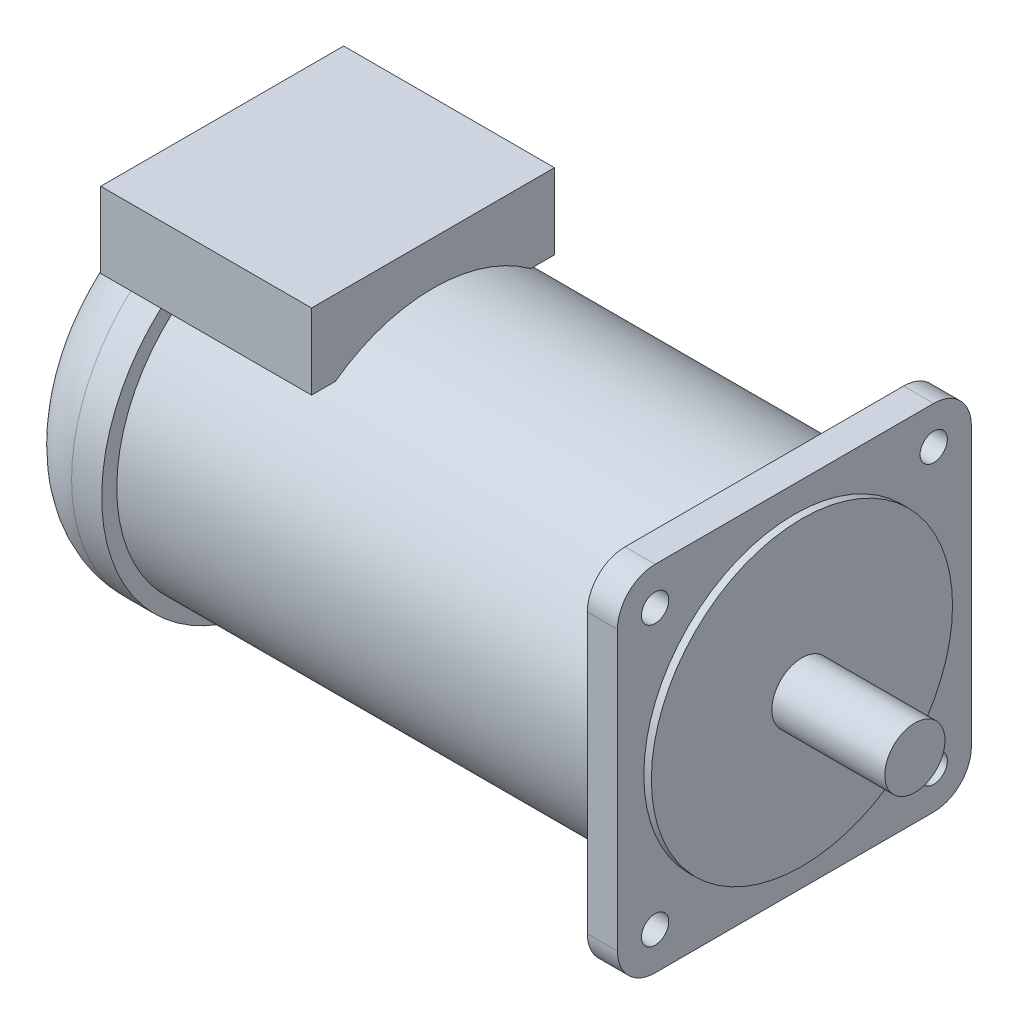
from build123d import *

# Parameters (mm, degrees)
BOSS_EXTRUDE1_DEPTH     = 12.7
SKETCH3_W               = 102.447825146
SKETCH3_H               = 31.827107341
BOSS_EXTRUDE2_DEPTH     = 88.9
SKETCH4_R               = 63.5
PILOT_DIA_DEPTH         = 3.175
F_1_2_20_TAPPED_HOLE2_D = 11.50874
CIRPATTERN2_COUNT       = 4


with BuildPart() as part:
    # Sketch1 → Base-Revolve (revolve)
    with BuildSketch(Plane.XY, mode=Mode.PRIVATE) as base_revolve_sk:
        with BuildLine():
            Line((0, 0), (0, 12.7))
            Line((0, 12.7), (-50.8, 12.7))
            Line((-50.8, 12.7), (-50.8, 69.85))
            Line((-50.8, 69.85), (-266.7, 69.85))
            Line((-266.7, 69.85), (-266.7, 76.2))
            Line((-266.7, 76.2), (-279.4, 76.2))
            ThreePointArc((-279.4, 76.2), (-297.360512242, 68.760512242), (-304.8, 50.8))
            Line((-304.8, 50.8), (-304.8, 0))
            Line((-304.8, 0), (0, 0))
        make_face()
    revolve(base_revolve_sk.sketch.rotate(Axis((0, 0, 0), (1, 0, 0)), 90), axis=Axis((0, 0, 0), (1, 0, 0)))

    # Sketch2 → Boss-Extrude1 (add)
    with BuildSketch(Plane(origin=(-50.8, 0, 0), x_dir=(0, 0, -1), z_dir=(1, 0, 0))):
        with BuildLine():
            Line((74.6125, -58.7375), (74.6125, 58.7375))
            ThreePointArc((74.6125, 58.7375), (69.962820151, 69.962820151), (58.7375, 74.6125))
            Line((58.7375, 74.6125), (-58.7375, 74.6125))
            ThreePointArc((-58.7375, 74.6125), (-69.962820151, 69.962820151), (-74.6125, 58.7375))
            Line((-74.6125, 58.7375), (-74.6125, -58.7375))
            ThreePointArc((-74.6125, -58.7375), (-69.962820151, -69.962820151), (-58.7375, -74.6125))
            Line((-58.7375, -74.6125), (58.7375, -74.6125))
            ThreePointArc((58.7375, -74.6125), (69.962820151, -69.962820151), (74.6125, -58.7375))
        make_face()
    extrude(amount=-BOSS_EXTRUDE1_DEPTH)

    # Sketch3 → Boss-Extrude2 (add)
    with BuildSketch(Plane(origin=(-203.2, 0, 0), x_dir=(0, 0, -1), z_dir=(1, 0, 0))):
        with Locations((0, 72.327654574)):
            Rectangle(SKETCH3_W, SKETCH3_H)
    extrude(amount=-BOSS_EXTRUDE2_DEPTH)

    # Sketch4 → pilot dia (add)
    with BuildSketch(Plane(origin=(-50.8, 0, 0), x_dir=(0, 0, -1), z_dir=(1, 0, 0))):
        with Locations(Location((0, 0, 0), (0, 0, 180))):
            Circle(SKETCH4_R)
    extrude(amount=PILOT_DIA_DEPTH)

    # 1_2-20 Tapped Hole2 (through all)
    with Locations(Plane.ZY.offset(63.5)):
        with Locations((58.7375, 58.7375)):
            f_1_2_20_tapped_hole2 = Hole(F_1_2_20_TAPPED_HOLE2_D / 2)

    # CirPattern2: 1_2-20 Tapped Hole2 ×4 about axis
    cirpattern2_axis = Axis((0, 0, 0), (1, 0, 0))
    for i in range(1, CIRPATTERN2_COUNT):
        add(f_1_2_20_tapped_hole2.rotate(cirpattern2_axis, i * 360 / CIRPATTERN2_COUNT), mode=Mode.SUBTRACT)


solid = part.part
